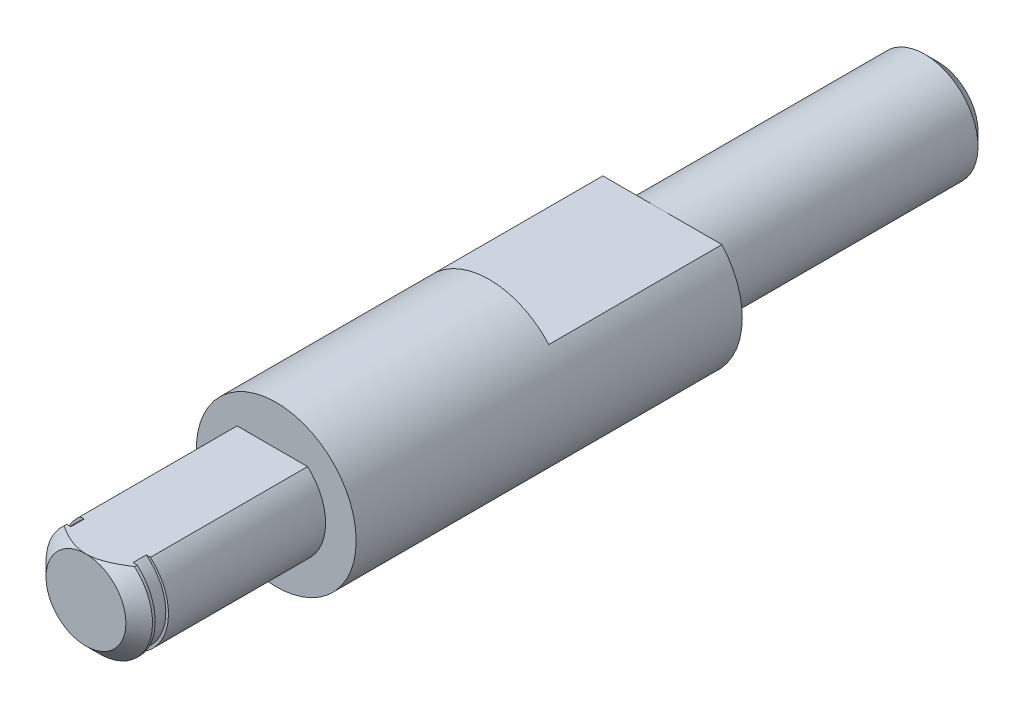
ISO-10303-21;
HEADER;
FILE_DESCRIPTION(('STEP AP214'),'2;1');
FILE_NAME('part.step','',(''),(''),'','','');
FILE_SCHEMA(('AUTOMOTIVE_DESIGN { 1 0 10303 214 1 1 1 1 }'));
ENDSEC;
DATA;
#1=APPLICATION_CONTEXT('core data for automotive mechanical design processes');
#2=APPLICATION_PROTOCOL_DEFINITION('international standard','automotive_design',2000,#1);
#3=PRODUCT_CONTEXT('',#1,'mechanical');
#4=PRODUCT('Part','Part','',(#3));
#5=PRODUCT_RELATED_PRODUCT_CATEGORY('part','',(#4));
#6=PRODUCT_DEFINITION_FORMATION('','',#4);
#7=PRODUCT_DEFINITION_CONTEXT('part definition',#1,'design');
#8=PRODUCT_DEFINITION('design','',#6,#7);
#9=PRODUCT_DEFINITION_SHAPE('','',#8);
#10=(LENGTH_UNIT() NAMED_UNIT(*) SI_UNIT(.MILLI.,.METRE.));
#11=(NAMED_UNIT(*) PLANE_ANGLE_UNIT() SI_UNIT($,.RADIAN.));
#12=(NAMED_UNIT(*) SI_UNIT($,.STERADIAN.) SOLID_ANGLE_UNIT());
#13=UNCERTAINTY_MEASURE_WITH_UNIT(LENGTH_MEASURE(1.E-05),#10,'distance_accuracy_value','');
#14=(GEOMETRIC_REPRESENTATION_CONTEXT(3) GLOBAL_UNCERTAINTY_ASSIGNED_CONTEXT((#13)) GLOBAL_UNIT_ASSIGNED_CONTEXT((#10,
#11,#12)) REPRESENTATION_CONTEXT('',''));
#15=CARTESIAN_POINT('',(0.,0.,0.));
#16=DIRECTION('',(0.,0.,1.));
#17=DIRECTION('',(1.,0.,0.));
#18=AXIS2_PLACEMENT_3D('',#15,#16,#17);
#19=CARTESIAN_POINT('',(0.,0.,8.));
#20=DIRECTION('',(0.,0.,-1.));
#21=DIRECTION('',(-1.,0.,0.));
#22=AXIS2_PLACEMENT_3D('',#19,#20,#21);
#23=CYLINDRICAL_SURFACE('',#22,2.);
#24=DIRECTION('',(0.,0.,-1.));
#25=VECTOR('',#24,1.);
#26=CARTESIAN_POINT('',(1.3228756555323,1.5,8.));
#27=LINE('',#26,#25);
#28=CARTESIAN_POINT('',(1.32287565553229,1.5,1.));
#29=VERTEX_POINT('',#28);
#30=CARTESIAN_POINT('',(1.32287565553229,1.5,6.9));
#31=VERTEX_POINT('',#30);
#32=EDGE_CURVE('E175',#29,#31,#27,.F.);
#33=ORIENTED_EDGE('',*,*,#32,.T.);
#34=CARTESIAN_POINT('',(0.,0.,6.9));
#35=DIRECTION('',(0.,0.,-1.));
#36=DIRECTION('',(-1.,0.,0.));
#37=AXIS2_PLACEMENT_3D('',#34,#35,#36);
#38=CIRCLE('',#37,2.);
#39=CARTESIAN_POINT('',(-1.3228756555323,1.5,6.9));
#40=VERTEX_POINT('',#39);
#41=EDGE_CURVE('E176',#31,#40,#38,.T.);
#42=ORIENTED_EDGE('',*,*,#41,.T.);
#43=DIRECTION('',(0.,0.,-1.));
#44=VECTOR('',#43,1.);
#45=CARTESIAN_POINT('',(-1.3228756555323,1.5,8.));
#46=LINE('',#45,#44);
#47=CARTESIAN_POINT('',(-1.3228756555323,1.5,1.));
#48=VERTEX_POINT('',#47);
#49=EDGE_CURVE('E180',#40,#48,#46,.T.);
#50=ORIENTED_EDGE('',*,*,#49,.T.);
#51=CARTESIAN_POINT('',(0.,0.,1.));
#52=DIRECTION('',(0.,0.,1.));
#53=DIRECTION('',(1.,0.,0.));
#54=AXIS2_PLACEMENT_3D('',#51,#52,#53);
#55=CIRCLE('',#54,2.);
#56=EDGE_CURVE('E178',#48,#29,#55,.T.);
#57=ORIENTED_EDGE('',*,*,#56,.T.);
#58=EDGE_LOOP('',(#33,#42,#50,#57));
#59=FACE_BOUND('',#58,.T.);
#60=ADVANCED_FACE('F32',(#59),#23,.T.);
#61=CARTESIAN_POINT('',(0.147650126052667,0.,-13.5));
#62=DIRECTION('',(0.,0.,1.));
#63=DIRECTION('',(1.,0.,0.));
#64=AXIS2_PLACEMENT_3D('',#61,#62,#63);
#65=PLANE('',#64);
#66=DIRECTION('',(1.,0.,0.));
#67=VECTOR('',#66,1.);
#68=CARTESIAN_POINT('',(0.147650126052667,2.,-13.5));
#69=LINE('',#68,#67);
#70=CARTESIAN_POINT('',(-2.08841785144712,2.,-13.5));
#71=VERTEX_POINT('',#70);
#72=CARTESIAN_POINT('',(0.,2.,-13.5));
#73=VERTEX_POINT('',#72);
#74=EDGE_CURVE('E191',#71,#73,#69,.T.);
#75=ORIENTED_EDGE('',*,*,#74,.T.);
#76=CARTESIAN_POINT('',(0.,0.,-13.5));
#77=DIRECTION('',(0.,0.,-1.));
#78=DIRECTION('',(-1.,0.,0.));
#79=AXIS2_PLACEMENT_3D('',#76,#77,#78);
#80=CIRCLE('',#79,2.);
#81=EDGE_CURVE('E250',#73,#73,#80,.T.);
#82=ORIENTED_EDGE('',*,*,#81,.F.);
#83=CARTESIAN_POINT('',(2.38371810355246,2.,-13.5));
#84=VERTEX_POINT('',#83);
#85=EDGE_CURVE('E190',#73,#84,#69,.T.);
#86=ORIENTED_EDGE('',*,*,#85,.T.);
#87=CARTESIAN_POINT('',(0.147650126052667,0.,-13.5));
#88=DIRECTION('',(0.,0.,1.));
#89=DIRECTION('',(1.,0.,0.));
#90=AXIS2_PLACEMENT_3D('',#87,#88,#89);
#91=CIRCLE('',#90,3.);
#92=EDGE_CURVE('E235',#71,#84,#91,.T.);
#93=ORIENTED_EDGE('',*,*,#92,.F.);
#94=EDGE_LOOP('',(#75,#82,#86,#93));
#95=FACE_BOUND('',#94,.T.);
#96=ADVANCED_FACE('F164',(#95),#65,.F.);
#97=CARTESIAN_POINT('',(0.147650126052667,0.,1.));
#98=DIRECTION('',(0.,0.,1.));
#99=DIRECTION('',(1.,0.,0.));
#100=AXIS2_PLACEMENT_3D('',#97,#98,#99);
#101=PLANE('',#100);
#102=CARTESIAN_POINT('',(0.147650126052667,0.,1.));
#103=DIRECTION('',(0.,0.,1.));
#104=DIRECTION('',(1.,0.,0.));
#105=AXIS2_PLACEMENT_3D('',#102,#103,#104);
#106=CIRCLE('',#105,3.);
#107=CARTESIAN_POINT('',(3.14765012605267,0.,1.));
#108=VERTEX_POINT('',#107);
#109=EDGE_CURVE('E234',#108,#108,#106,.T.);
#110=ORIENTED_EDGE('',*,*,#109,.T.);
#111=EDGE_LOOP('',(#110));
#112=FACE_BOUND('',#111,.T.);
#113=ORIENTED_EDGE('',*,*,#56,.F.);
#114=DIRECTION('',(-1.,0.,0.));
#115=VECTOR('',#114,1.);
#116=CARTESIAN_POINT('',(-3.05047143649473,1.5,1.));
#117=LINE('',#116,#115);
#118=EDGE_CURVE('E188',#29,#48,#117,.T.);
#119=ORIENTED_EDGE('',*,*,#118,.F.);
#120=EDGE_LOOP('',(#113,#119));
#121=FACE_BOUND('',#120,.T.);
#122=ADVANCED_FACE('F169',(#112,#121),#101,.T.);
#123=CARTESIAN_POINT('',(0.147650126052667,0.,-13.5));
#124=DIRECTION('',(0.,0.,1.));
#125=DIRECTION('',(1.,0.,0.));
#126=AXIS2_PLACEMENT_3D('',#123,#124,#125);
#127=CYLINDRICAL_SURFACE('',#126,3.);
#128=DIRECTION('',(0.,0.,1.));
#129=VECTOR('',#128,1.);
#130=CARTESIAN_POINT('',(2.38371810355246,2.,-13.5));
#131=LINE('',#130,#129);
#132=CARTESIAN_POINT('',(2.38371810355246,2.,-7.));
#133=VERTEX_POINT('',#132);
#134=EDGE_CURVE('E240',#133,#84,#131,.F.);
#135=ORIENTED_EDGE('',*,*,#134,.F.);
#136=CARTESIAN_POINT('',(0.147650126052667,0.,-7.));
#137=DIRECTION('',(0.,0.,-1.));
#138=DIRECTION('',(-1.,0.,0.));
#139=AXIS2_PLACEMENT_3D('',#136,#137,#138);
#140=CIRCLE('',#139,3.);
#141=CARTESIAN_POINT('',(-2.08841785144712,2.,-7.));
#142=VERTEX_POINT('',#141);
#143=EDGE_CURVE('E193',#133,#142,#140,.F.);
#144=ORIENTED_EDGE('',*,*,#143,.T.);
#145=DIRECTION('',(0.,0.,1.));
#146=VECTOR('',#145,1.);
#147=CARTESIAN_POINT('',(-2.08841785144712,2.,-13.5));
#148=LINE('',#147,#146);
#149=EDGE_CURVE('E245',#71,#142,#148,.T.);
#150=ORIENTED_EDGE('',*,*,#149,.F.);
#151=ORIENTED_EDGE('',*,*,#92,.T.);
#152=EDGE_LOOP('',(#135,#144,#150,#151));
#153=FACE_BOUND('',#152,.T.);
#154=ORIENTED_EDGE('',*,*,#109,.F.);
#155=EDGE_LOOP('',(#154));
#156=FACE_BOUND('',#155,.T.);
#157=ADVANCED_FACE('F154',(#153,#156),#127,.T.);
#158=CARTESIAN_POINT('',(-1.3228756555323,1.5,7.49999999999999));
#159=VERTEX_POINT('',#158);
#160=CARTESIAN_POINT('',(-1.3228756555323,1.5,7.4));
#161=VERTEX_POINT('',#160);
#162=EDGE_CURVE('E183',#159,#161,#46,.T.);
#163=ORIENTED_EDGE('',*,*,#162,.T.);
#164=CARTESIAN_POINT('',(0.,0.,7.4));
#165=DIRECTION('',(0.,0.,1.));
#166=DIRECTION('',(1.,0.,0.));
#167=AXIS2_PLACEMENT_3D('',#164,#165,#166);
#168=CIRCLE('',#167,2.);
#169=CARTESIAN_POINT('',(1.32287565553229,1.5,7.4));
#170=VERTEX_POINT('',#169);
#171=EDGE_CURVE('E48',#161,#170,#168,.T.);
#172=ORIENTED_EDGE('',*,*,#171,.T.);
#173=CARTESIAN_POINT('',(1.3228756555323,1.5,7.49999999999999));
#174=VERTEX_POINT('',#173);
#175=EDGE_CURVE('E181',#170,#174,#27,.F.);
#176=ORIENTED_EDGE('',*,*,#175,.T.);
#177=CARTESIAN_POINT('',(0.,0.,7.49999999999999));
#178=DIRECTION('',(0.,0.,1.));
#179=DIRECTION('',(1.,0.,0.));
#180=AXIS2_PLACEMENT_3D('',#177,#178,#179);
#181=CIRCLE('',#180,2.);
#182=EDGE_CURVE('E56',#174,#159,#181,.F.);
#183=ORIENTED_EDGE('',*,*,#182,.T.);
#184=EDGE_LOOP('',(#163,#172,#176,#183));
#185=FACE_BOUND('',#184,.T.);
#186=ADVANCED_FACE('F34',(#185),#23,.T.);
#187=CARTESIAN_POINT('',(0.,0.,8.));
#188=DIRECTION('',(0.,0.,1.));
#189=DIRECTION('',(1.,0.,0.));
#190=AXIS2_PLACEMENT_3D('',#187,#188,#189);
#191=PLANE('',#190);
#192=CARTESIAN_POINT('',(0.,0.,8.));
#193=DIRECTION('',(0.,0.,1.));
#194=DIRECTION('',(1.,0.,0.));
#195=AXIS2_PLACEMENT_3D('',#192,#193,#194);
#196=CIRCLE('',#195,1.5);
#197=CARTESIAN_POINT('',(0.,1.5,8.));
#198=VERTEX_POINT('',#197);
#199=EDGE_CURVE('E195',#198,#198,#196,.T.);
#200=ORIENTED_EDGE('',*,*,#199,.T.);
#201=EDGE_LOOP('',(#200));
#202=FACE_BOUND('',#201,.T.);
#203=ADVANCED_FACE('F153',(#202),#191,.T.);
#204=CARTESIAN_POINT('',(-3.05047143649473,1.5,0.));
#205=DIRECTION('',(0.,-1.,0.));
#206=DIRECTION('',(0.,0.,-1.));
#207=AXIS2_PLACEMENT_3D('',#204,#205,#206);
#208=PLANE('',#207);
#209=DIRECTION('',(0.,0.,-1.));
#210=VECTOR('',#209,1.);
#211=CARTESIAN_POINT('',(1.16619037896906,1.5,-0.109554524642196));
#212=LINE('',#211,#210);
#213=CARTESIAN_POINT('',(1.16619037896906,1.5,7.4));
#214=VERTEX_POINT('',#213);
#215=CARTESIAN_POINT('',(1.16619037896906,1.5,6.9));
#216=VERTEX_POINT('',#215);
#217=EDGE_CURVE('E36',#214,#216,#212,.T.);
#218=ORIENTED_EDGE('',*,*,#217,.T.);
#219=DIRECTION('',(1.,0.,0.));
#220=VECTOR('',#219,1.);
#221=CARTESIAN_POINT('',(-3.05047143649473,1.5,6.9));
#222=LINE('',#221,#220);
#223=EDGE_CURVE('E11',#216,#31,#222,.T.);
#224=ORIENTED_EDGE('',*,*,#223,.T.);
#225=ORIENTED_EDGE('',*,*,#32,.F.);
#226=ORIENTED_EDGE('',*,*,#118,.T.);
#227=ORIENTED_EDGE('',*,*,#49,.F.);
#228=CARTESIAN_POINT('',(-1.16619037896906,1.5,6.9));
#229=VERTEX_POINT('',#228);
#230=EDGE_CURVE('E41',#40,#229,#222,.T.);
#231=ORIENTED_EDGE('',*,*,#230,.T.);
#232=DIRECTION('',(0.,0.,-1.));
#233=VECTOR('',#232,1.);
#234=CARTESIAN_POINT('',(-1.16619037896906,1.5,-0.109554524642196));
#235=LINE('',#234,#233);
#236=CARTESIAN_POINT('',(-1.16619037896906,1.5,7.4));
#237=VERTEX_POINT('',#236);
#238=EDGE_CURVE('E110',#229,#237,#235,.F.);
#239=ORIENTED_EDGE('',*,*,#238,.T.);
#240=DIRECTION('',(-1.,0.,0.));
#241=VECTOR('',#240,1.);
#242=CARTESIAN_POINT('',(-3.05047143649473,1.5,7.4));
#243=LINE('',#242,#241);
#244=EDGE_CURVE('E103',#237,#161,#243,.T.);
#245=ORIENTED_EDGE('',*,*,#244,.T.);
#246=ORIENTED_EDGE('',*,*,#162,.F.);
#247=CARTESIAN_POINT('',(-1.3228756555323,1.5,7.49999999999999));
#248=CARTESIAN_POINT('',(-1.28978652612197,1.5,7.52188338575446));
#249=CARTESIAN_POINT('',(-1.25648829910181,1.5,7.54344964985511));
#250=CARTESIAN_POINT('',(-1.18940821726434,1.5,7.58583855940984));
#251=CARTESIAN_POINT('',(-1.15562621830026,1.5,7.60666097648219));
#252=CARTESIAN_POINT('',(-1.05313237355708,1.5,7.66804076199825));
#253=CARTESIAN_POINT('',(-0.983616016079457,1.5,7.70728035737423));
#254=CARTESIAN_POINT('',(-0.844330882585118,1.5,7.77968875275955));
#255=CARTESIAN_POINT('',(-0.774644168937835,1.5,7.81301372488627));
#256=CARTESIAN_POINT('',(-0.632661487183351,1.5,7.87330114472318));
#257=CARTESIAN_POINT('',(-0.560371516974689,1.5,7.90027725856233));
#258=CARTESIAN_POINT('',(-0.447711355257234,1.5,7.93505065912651));
#259=CARTESIAN_POINT('',(-0.408281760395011,1.5,7.94590741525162));
#260=CARTESIAN_POINT('',(-0.328766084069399,1.5,7.9648791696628));
#261=CARTESIAN_POINT('',(-0.288680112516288,1.5,7.97299462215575));
#262=CARTESIAN_POINT('',(-0.207337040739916,1.5,7.98627638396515));
#263=CARTESIAN_POINT('',(-0.166071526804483,1.5,7.99139189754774));
#264=CARTESIAN_POINT('',(-0.0832091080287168,1.5,7.99826912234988));
#265=CARTESIAN_POINT('',(-0.0416118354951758,1.5,8.00002636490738));
#266=CARTESIAN_POINT('',(0.,1.5,8.));
#267=B_SPLINE_CURVE_WITH_KNOTS('',3,(#247,#248,#249,#250,#251,#252,#253,#254,#255,#256,#257,
#258,#259,#260,#261,#262,#263,#264,#265,#266),.UNSPECIFIED.,.F.,.F.,(4,2,2,2,2,2,2,2,2,4),(0.,
0.119008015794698,0.238052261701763,0.477379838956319,0.708907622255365,0.939932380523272,
1.06254219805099,1.18513169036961,1.30974106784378,1.43451614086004),.UNSPECIFIED.);
#268=EDGE_CURVE('E140',#159,#198,#267,.T.);
#269=ORIENTED_EDGE('',*,*,#268,.T.);
#270=CARTESIAN_POINT('',(0.,1.5,8.));
#271=CARTESIAN_POINT('',(0.046137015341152,1.5,8.00003866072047));
#272=CARTESIAN_POINT('',(0.0922502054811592,1.5,7.99787225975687));
#273=CARTESIAN_POINT('',(0.184012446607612,1.5,7.98943443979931));
#274=CARTESIAN_POINT('',(0.229662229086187,1.5,7.98317105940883));
#275=CARTESIAN_POINT('',(0.319483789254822,1.5,7.96698285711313));
#276=CARTESIAN_POINT('',(0.36366748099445,1.5,7.95712297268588));
#277=CARTESIAN_POINT('',(0.451194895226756,1.5,7.93417943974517));
#278=CARTESIAN_POINT('',(0.494538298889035,1.5,7.92109459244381));
#279=CARTESIAN_POINT('',(0.606395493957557,1.5,7.88336991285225));
#280=CARTESIAN_POINT('',(0.67417106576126,1.5,7.85654470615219));
#281=CARTESIAN_POINT('',(0.807413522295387,1.5,7.79754840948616));
#282=CARTESIAN_POINT('',(0.872876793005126,1.5,7.76536936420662));
#283=CARTESIAN_POINT('',(1.00366784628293,1.5,7.69606932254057));
#284=CARTESIAN_POINT('',(1.06893080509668,1.5,7.65882767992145));
#285=CARTESIAN_POINT('',(1.19733148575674,1.5,7.58139251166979));
#286=CARTESIAN_POINT('',(1.2604767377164,1.5,7.54121153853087));
#287=CARTESIAN_POINT('',(1.32287565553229,1.5,7.49999999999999));
#288=B_SPLINE_CURVE_WITH_KNOTS('',3,(#270,#271,#272,#273,#274,#275,#276,#277,#278,#279,#280,
#281,#282,#283,#284,#285,#286,#287),.UNSPECIFIED.,.F.,.F.,(4,2,2,2,2,2,2,2,4),(0.,
0.138322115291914,0.276373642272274,0.412046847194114,0.547770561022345,0.766109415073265,
0.984775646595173,1.21010028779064,1.43451329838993),.UNSPECIFIED.);
#289=EDGE_CURVE('E132',#198,#174,#288,.T.);
#290=ORIENTED_EDGE('',*,*,#289,.T.);
#291=ORIENTED_EDGE('',*,*,#175,.F.);
#292=EDGE_CURVE('E113',#170,#214,#243,.T.);
#293=ORIENTED_EDGE('',*,*,#292,.T.);
#294=EDGE_LOOP('',(#218,#224,#225,#226,#227,#231,#239,#245,#246,#269,#290,#291,#293));
#295=FACE_BOUND('',#294,.T.);
#296=ADVANCED_FACE('F122',(#295),#208,.F.);
#297=CARTESIAN_POINT('',(3.46372333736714,2.,-7.));
#298=DIRECTION('',(0.,-1.,0.));
#299=DIRECTION('',(0.,0.,-1.));
#300=AXIS2_PLACEMENT_3D('',#297,#298,#299);
#301=PLANE('',#300);
#302=ORIENTED_EDGE('',*,*,#134,.T.);
#303=ORIENTED_EDGE('',*,*,#85,.F.);
#304=ORIENTED_EDGE('',*,*,#74,.F.);
#305=ORIENTED_EDGE('',*,*,#149,.T.);
#306=DIRECTION('',(-1.,0.,0.));
#307=VECTOR('',#306,1.);
#308=CARTESIAN_POINT('',(3.46372333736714,2.,-7.));
#309=LINE('',#308,#307);
#310=EDGE_CURVE('E247',#133,#142,#309,.T.);
#311=ORIENTED_EDGE('',*,*,#310,.F.);
#312=EDGE_LOOP('',(#302,#303,#304,#305,#311));
#313=FACE_BOUND('',#312,.T.);
#314=ADVANCED_FACE('F152',(#313),#301,.F.);
#315=CARTESIAN_POINT('',(3.46372333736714,2.,-7.));
#316=DIRECTION('',(0.,0.,-1.));
#317=DIRECTION('',(-1.,0.,0.));
#318=AXIS2_PLACEMENT_3D('',#315,#316,#317);
#319=PLANE('',#318);
#320=ORIENTED_EDGE('',*,*,#310,.T.);
#321=ORIENTED_EDGE('',*,*,#143,.F.);
#322=EDGE_LOOP('',(#320,#321));
#323=FACE_BOUND('',#322,.T.);
#324=ADVANCED_FACE('F215',(#323),#319,.T.);
#325=CARTESIAN_POINT('',(0.,0.,-24.));
#326=DIRECTION('',(0.,0.,1.));
#327=DIRECTION('',(1.,0.,0.));
#328=AXIS2_PLACEMENT_3D('',#325,#326,#327);
#329=CYLINDRICAL_SURFACE('',#328,2.);
#330=CARTESIAN_POINT('',(0.,0.,-23.5));
#331=DIRECTION('',(0.,0.,-1.));
#332=DIRECTION('',(-1.,0.,0.));
#333=AXIS2_PLACEMENT_3D('',#330,#331,#332);
#334=CIRCLE('',#333,2.);
#335=CARTESIAN_POINT('',(-2.,0.,-23.5));
#336=VERTEX_POINT('',#335);
#337=EDGE_CURVE('E111',#336,#336,#334,.F.);
#338=ORIENTED_EDGE('',*,*,#337,.T.);
#339=EDGE_LOOP('',(#338));
#340=FACE_BOUND('',#339,.T.);
#341=ORIENTED_EDGE('',*,*,#81,.T.);
#342=EDGE_LOOP('',(#341));
#343=FACE_BOUND('',#342,.T.);
#344=ADVANCED_FACE('F210',(#340,#343),#329,.T.);
#345=CARTESIAN_POINT('',(0.,0.,-24.));
#346=DIRECTION('',(0.,0.,-1.));
#347=DIRECTION('',(-1.,0.,0.));
#348=AXIS2_PLACEMENT_3D('',#345,#346,#347);
#349=PLANE('',#348);
#350=CARTESIAN_POINT('',(0.,0.,-24.));
#351=DIRECTION('',(0.,0.,-1.));
#352=DIRECTION('',(-1.,0.,0.));
#353=AXIS2_PLACEMENT_3D('',#350,#351,#352);
#354=CIRCLE('',#353,1.50000000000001);
#355=CARTESIAN_POINT('',(-1.50000000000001,0.,-24.));
#356=VERTEX_POINT('',#355);
#357=EDGE_CURVE('E128',#356,#356,#354,.T.);
#358=ORIENTED_EDGE('',*,*,#357,.T.);
#359=EDGE_LOOP('',(#358));
#360=FACE_BOUND('',#359,.T.);
#361=ADVANCED_FACE('F203',(#360),#349,.T.);
#362=CARTESIAN_POINT('',(0.,0.,8.));
#363=DIRECTION('',(0.,0.,-1.));
#364=DIRECTION('',(-1.,0.,0.));
#365=AXIS2_PLACEMENT_3D('',#362,#363,#364);
#366=CONICAL_SURFACE('',#365,1.5,0.785398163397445);
#367=ORIENTED_EDGE('',*,*,#268,.F.);
#368=ORIENTED_EDGE('',*,*,#182,.F.);
#369=ORIENTED_EDGE('',*,*,#289,.F.);
#370=ORIENTED_EDGE('',*,*,#199,.F.);
#371=EDGE_LOOP('',(#367,#368,#369,#370));
#372=FACE_BOUND('',#371,.T.);
#373=ADVANCED_FACE('F145',(#372),#366,.T.);
#374=CARTESIAN_POINT('',(0.,0.,-24.));
#375=DIRECTION('',(0.,0.,1.));
#376=DIRECTION('',(1.,0.,0.));
#377=AXIS2_PLACEMENT_3D('',#374,#375,#376);
#378=CONICAL_SURFACE('',#377,1.50000000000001,0.785398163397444);
#379=ORIENTED_EDGE('',*,*,#337,.F.);
#380=EDGE_LOOP('',(#379));
#381=FACE_BOUND('',#380,.T.);
#382=ORIENTED_EDGE('',*,*,#357,.F.);
#383=EDGE_LOOP('',(#382));
#384=FACE_BOUND('',#383,.T.);
#385=ADVANCED_FACE('F202',(#381,#384),#378,.T.);
#386=CARTESIAN_POINT('',(0.,2.72004571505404,6.9));
#387=DIRECTION('',(0.,0.,-1.));
#388=DIRECTION('',(-1.,0.,0.));
#389=AXIS2_PLACEMENT_3D('',#386,#387,#388);
#390=PLANE('',#389);
#391=ORIENTED_EDGE('',*,*,#41,.F.);
#392=ORIENTED_EDGE('',*,*,#223,.F.);
#393=CARTESIAN_POINT('',(0.,0.,6.9));
#394=DIRECTION('',(0.,0.,-1.));
#395=DIRECTION('',(-1.,0.,0.));
#396=AXIS2_PLACEMENT_3D('',#393,#394,#395);
#397=CIRCLE('',#396,1.9);
#398=EDGE_CURVE('E119',#216,#229,#397,.T.);
#399=ORIENTED_EDGE('',*,*,#398,.T.);
#400=ORIENTED_EDGE('',*,*,#230,.F.);
#401=EDGE_LOOP('',(#391,#392,#399,#400));
#402=FACE_BOUND('',#401,.T.);
#403=ADVANCED_FACE('F208',(#402),#390,.F.);
#404=CARTESIAN_POINT('',(0.,0.,-0.109554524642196));
#405=DIRECTION('',(0.,0.,-1.));
#406=DIRECTION('',(-1.,0.,0.));
#407=AXIS2_PLACEMENT_3D('',#404,#405,#406);
#408=CYLINDRICAL_SURFACE('',#407,1.9);
#409=ORIENTED_EDGE('',*,*,#398,.F.);
#410=ORIENTED_EDGE('',*,*,#217,.F.);
#411=CARTESIAN_POINT('',(0.,0.,7.4));
#412=DIRECTION('',(0.,0.,-1.));
#413=DIRECTION('',(-1.,0.,0.));
#414=AXIS2_PLACEMENT_3D('',#411,#412,#413);
#415=CIRCLE('',#414,1.9);
#416=EDGE_CURVE('E106',#214,#237,#415,.T.);
#417=ORIENTED_EDGE('',*,*,#416,.T.);
#418=ORIENTED_EDGE('',*,*,#238,.F.);
#419=EDGE_LOOP('',(#409,#410,#417,#418));
#420=FACE_BOUND('',#419,.T.);
#421=ADVANCED_FACE('F116',(#420),#408,.T.);
#422=CARTESIAN_POINT('',(0.,2.72004571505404,7.4));
#423=DIRECTION('',(0.,0.,1.));
#424=DIRECTION('',(1.,0.,0.));
#425=AXIS2_PLACEMENT_3D('',#422,#423,#424);
#426=PLANE('',#425);
#427=ORIENTED_EDGE('',*,*,#171,.F.);
#428=ORIENTED_EDGE('',*,*,#244,.F.);
#429=ORIENTED_EDGE('',*,*,#416,.F.);
#430=ORIENTED_EDGE('',*,*,#292,.F.);
#431=EDGE_LOOP('',(#427,#428,#429,#430));
#432=FACE_BOUND('',#431,.T.);
#433=ADVANCED_FACE('F105',(#432),#426,.F.);
#434=CLOSED_SHELL('',(#60,#96,#122,#157,#186,#203,#296,#314,#324,#344,#361,#373,#385,#403,#421,#433));
#435=MANIFOLD_SOLID_BREP('B2',#434);
#436=ADVANCED_BREP_SHAPE_REPRESENTATION('',(#18,#435),#14);
#437=SHAPE_DEFINITION_REPRESENTATION(#9,#436);
ENDSEC;
END-ISO-10303-21;
